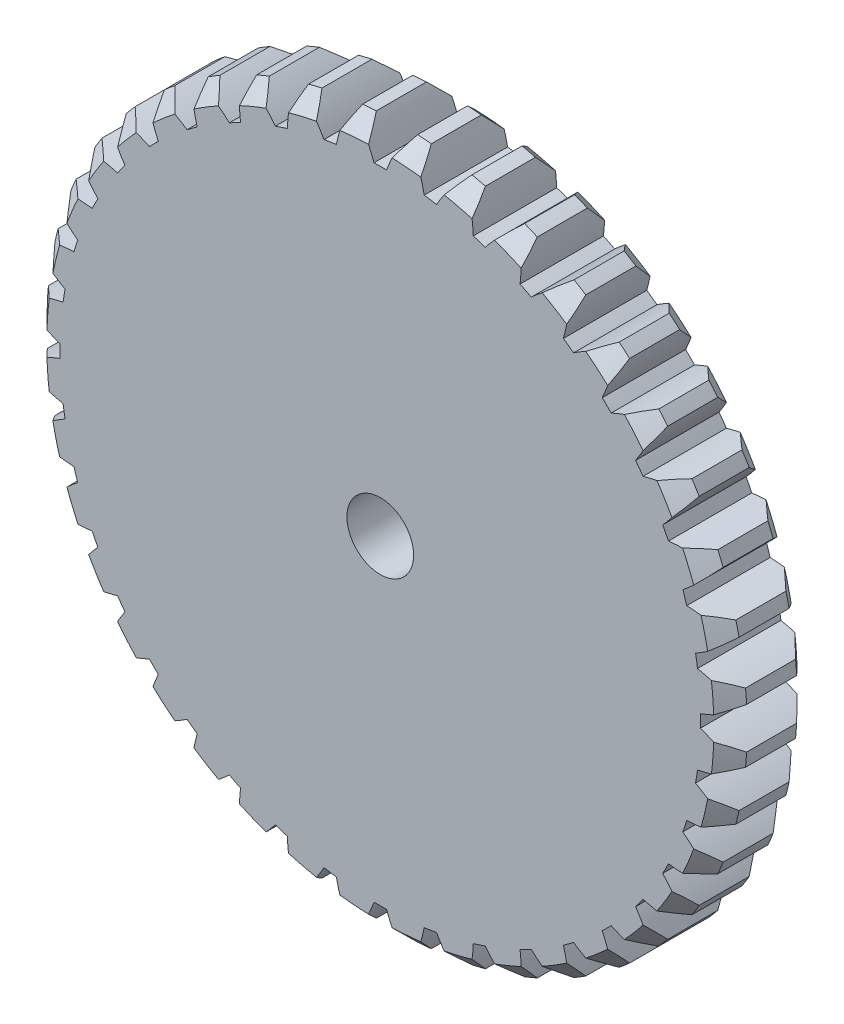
from build123d import *

# Parameters (mm, degrees)
SKETCH1_R               = 21
GEAR_BLANK_DEPTH        = 2.5
FRONT_GEAR_CHAMFER_SIZE = 1
REAR_GEAR_CHAMFER_SIZE  = 1
TOOTH_CUT_DEPTH         = 2.5
TOOTH_COPIES_COUNT      = 40
SKETCH4_R               = 2
EXTRUDE1_DEPTH          = 31.065648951


with BuildPart() as part:
    # Sketch1 → Gear Blank (new, symmetric)
    with BuildSketch(Plane.XY):
        Circle(SKETCH1_R)
    extrude(amount=GEAR_BLANK_DEPTH, both=True)

    # Front Gear Chamfer
    front_gear_chamfer_edges = [part.edges().sort_by_distance(p)[0] for p in [
        (-21, 0, 2.5),
    ]]
    chamfer(front_gear_chamfer_edges, length=FRONT_GEAR_CHAMFER_SIZE)

    # Rear Gear Chamfer
    rear_gear_chamfer_edges = [part.edges().sort_by_distance(p)[0] for p in [
        (-21, 0, -2.5),
    ]]
    chamfer(rear_gear_chamfer_edges, length=REAR_GEAR_CHAMFER_SIZE)

    # Sketch2 → Tooth Cut (cut, symmetric)
    with BuildSketch(Plane.XY):
        with BuildLine():
            ThreePointArc((1.236277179, 20.963578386), (-9.715e-06, 21), (-1.236296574, 20.963577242))
            ThreePointArc((-1.236296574, 20.963577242), (-0.763119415, 20.101097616), (-0.376975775, 19.196298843))
            ThreePointArc((-0.376975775, 19.196298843), (-8.882e-06, 19.2), (0.376958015, 19.196299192))
            ThreePointArc((0.376958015, 19.196299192), (0.763100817, 20.101098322), (1.236277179, 20.963578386))
        make_face()
    tooth_cut = extrude(amount=TOOTH_CUT_DEPTH, both=True, mode=Mode.SUBTRACT)

    # Tooth Copies: Tooth Cut ×40 about axis
    tooth_copies_axis = Axis((0, 0, 0), (0, 0, 1))
    for i in range(1, TOOTH_COPIES_COUNT):
        add(tooth_cut.rotate(tooth_copies_axis, i * 360 / TOOTH_COPIES_COUNT), mode=Mode.SUBTRACT)

    # Sketch4 → Extrude1 (cut, through all)
    with BuildSketch(Plane(origin=(0, 0, -2.5), x_dir=(-1, 0, 0), z_dir=(0, 0, -1))):
        Circle(SKETCH4_R)
    extrude(amount=-EXTRUDE1_DEPTH, mode=Mode.SUBTRACT)


solid = part.part
